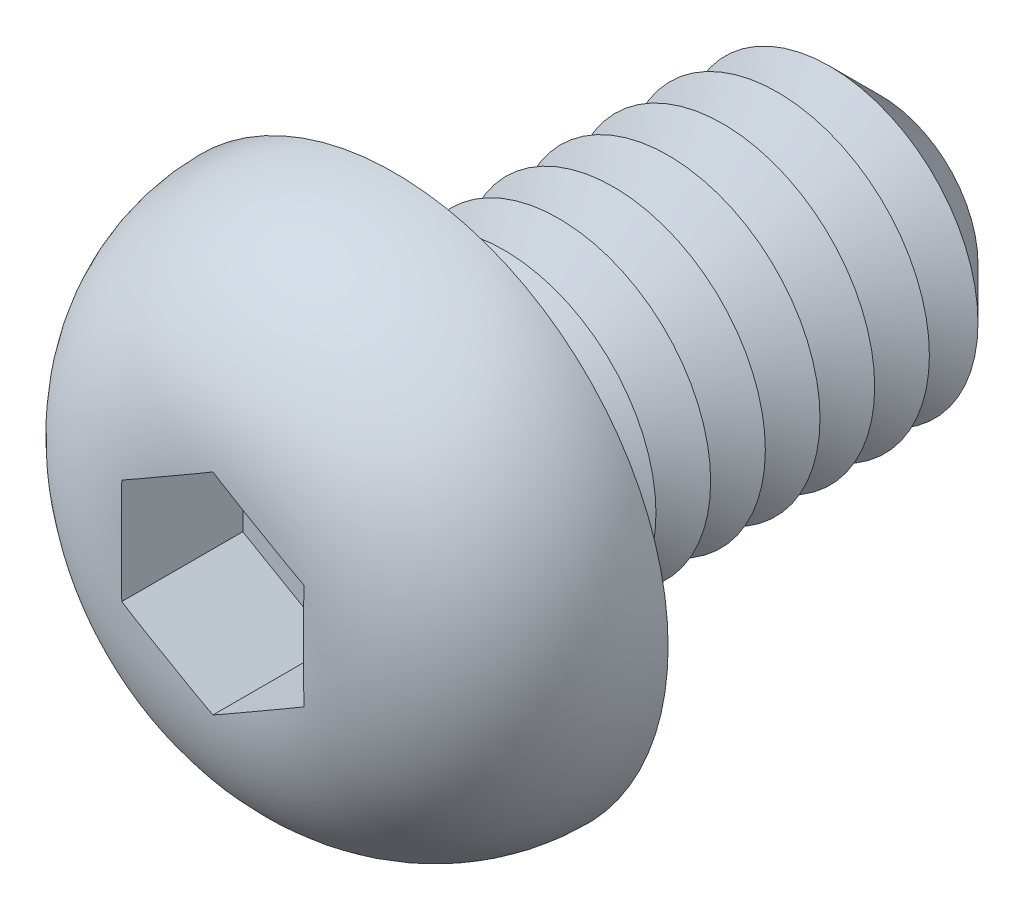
from build123d import *

# Parameters (mm, degrees)
CUT_EXTRUDE1_DEPTH  = 1
SKETCH4_R           = 1.25
BOSS_EXTRUDE1_DEPTH = 4
CHAMFER1_SIZE       = 0.45
LPATTERN1_COUNT     = 7
LPATTERN1_PITCH     = 0.45
FILLET2_R           = 0.225
SKETCH6_R           = 0.45
CUT_EXTRUDE2_DEPTH  = 4.5


with BuildPart() as part:
    # Sketch2 → Revolve1 (revolve)
    with BuildSketch(Plane(origin=(0, 0, 0), x_dir=(0, 0, -1), z_dir=(1, 0, 0)), mode=Mode.PRIVATE) as revolve1_sk:
        with BuildLine():
            Line((0, 0), (-1.5, 0))
            Line((-1.5, 0), (-1.5, 0.75))
            ThreePointArc((-1.5, 0.75), (-1.060660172, 1.810660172), (0, 2.25))
            Line((0, 2.25), (0, 0))
        make_face()
    revolve(revolve1_sk.sketch.rotate(Axis((0, 0, 47.934239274), (0, 0, -1)), 90), axis=Axis((0, 0, 47.934239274), (0, 0, -1)))

    # Sketch3 → Cut-Extrude1 (cut)
    with BuildSketch(Plane.XY.offset(1.5)):
        Polygon((0, 0.866025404), (-0.75, 0.433012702), (-0.75, -0.433012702), (0, -0.866025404), (0.75, -0.433012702), (0.75, 0.433012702), align=None)
    extrude(amount=-CUT_EXTRUDE1_DEPTH, mode=Mode.SUBTRACT)

    # Sketch4 → Boss-Extrude1 (add)
    with BuildSketch(Plane(origin=(0, 0, 0), x_dir=(-1, 0, 0), z_dir=(0, 0, -1))):
        with Locations(Location((0, 0, 0), (0, 0, 180))):
            Circle(SKETCH4_R)
    extrude(amount=BOSS_EXTRUDE1_DEPTH)

    # Chamfer1
    chamfer1_edges = [part.edges().sort_by_distance(p)[0] for p in [
        (-1.25, 0, -4),
    ]]
    chamfer(chamfer1_edges, length=CHAMFER1_SIZE)

    # Sketch5 → Cut-Revolve1 (revolve, cut)
    with BuildSketch(Plane(origin=(0, 0, 0), x_dir=(0, 0, -1), z_dir=(1, 0, 0)), mode=Mode.PRIVATE) as cut_revolve1_sk:
        Polygon((0.45, 1.25), (0.9, 1.25), (0.675, 0.860288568), align=None)
    cut_revolve1 = revolve(cut_revolve1_sk.sketch.rotate(Axis((0, 0, 47.934239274), (0, 0, -1)), 90), axis=Axis((0, 0, 47.934239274), (0, 0, -1)), mode=Mode.SUBTRACT)

    # LPattern1: Cut-Revolve1 ×7
    with Locations(*[(0, 0, -i * LPATTERN1_PITCH) for i in range(1, LPATTERN1_COUNT)]):
        add(cut_revolve1, mode=Mode.SUBTRACT)

    # Fillet2
    fillet2_edges = [part.edges().sort_by_distance(p)[0] for p in [
        (-1.25, 0, 0),
    ]]
    fillet(fillet2_edges, radius=FILLET2_R)

    # Sketch6 → Cut-Extrude2 (cut)
    with BuildSketch(Plane.XY.offset(0.5)):
        Circle(SKETCH6_R)
    extrude(amount=-CUT_EXTRUDE2_DEPTH, mode=Mode.SUBTRACT)


solid = part.part
